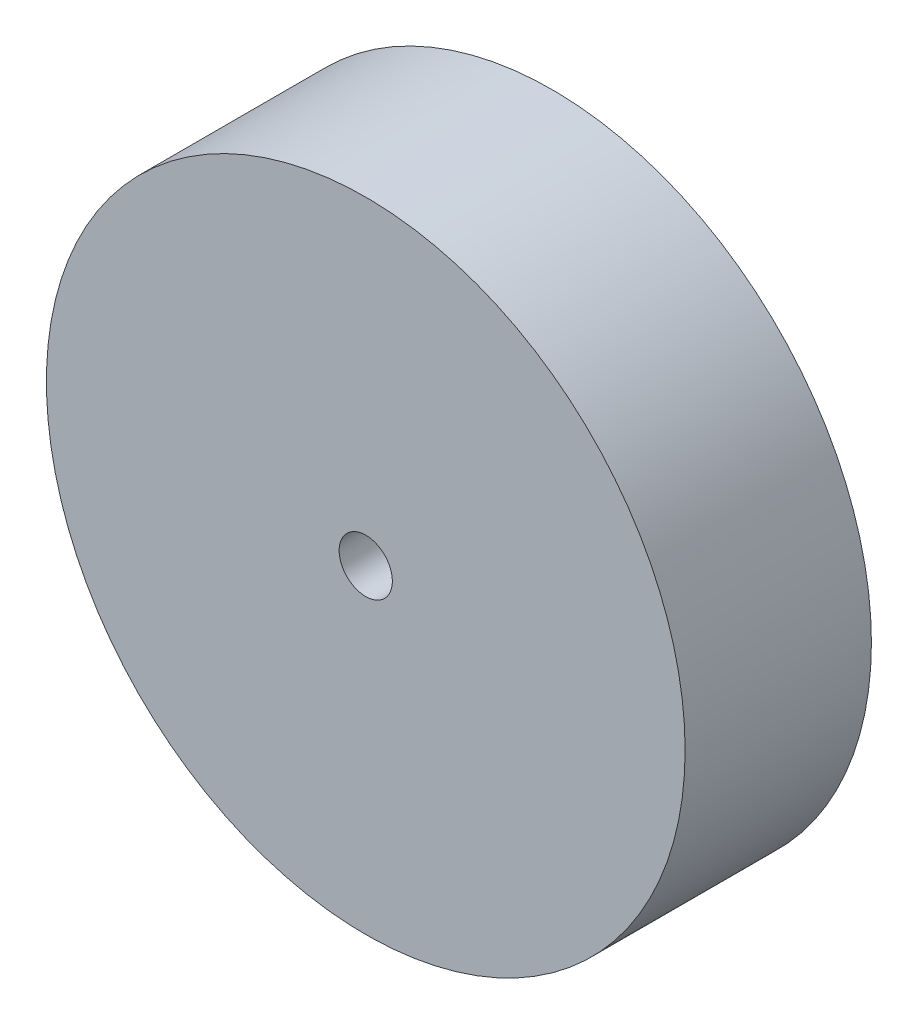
ISO-10303-21;
HEADER;
FILE_DESCRIPTION(('STEP AP214'),'2;1');
FILE_NAME('part.step','',(''),(''),'','','');
FILE_SCHEMA(('AUTOMOTIVE_DESIGN { 1 0 10303 214 1 1 1 1 }'));
ENDSEC;
DATA;
#1=APPLICATION_CONTEXT('core data for automotive mechanical design processes');
#2=APPLICATION_PROTOCOL_DEFINITION('international standard','automotive_design',2000,#1);
#3=PRODUCT_CONTEXT('',#1,'mechanical');
#4=PRODUCT('Part','Part','',(#3));
#5=PRODUCT_RELATED_PRODUCT_CATEGORY('part','',(#4));
#6=PRODUCT_DEFINITION_FORMATION('','',#4);
#7=PRODUCT_DEFINITION_CONTEXT('part definition',#1,'design');
#8=PRODUCT_DEFINITION('design','',#6,#7);
#9=PRODUCT_DEFINITION_SHAPE('','',#8);
#10=(LENGTH_UNIT() NAMED_UNIT(*) SI_UNIT(.MILLI.,.METRE.));
#11=(NAMED_UNIT(*) PLANE_ANGLE_UNIT() SI_UNIT($,.RADIAN.));
#12=(NAMED_UNIT(*) SI_UNIT($,.STERADIAN.) SOLID_ANGLE_UNIT());
#13=UNCERTAINTY_MEASURE_WITH_UNIT(LENGTH_MEASURE(1.E-05),#10,'distance_accuracy_value','');
#14=(GEOMETRIC_REPRESENTATION_CONTEXT(3) GLOBAL_UNCERTAINTY_ASSIGNED_CONTEXT((#13)) GLOBAL_UNIT_ASSIGNED_CONTEXT((#10,
#11,#12)) REPRESENTATION_CONTEXT('',''));
#15=CARTESIAN_POINT('',(0.,0.,0.));
#16=DIRECTION('',(0.,0.,1.));
#17=DIRECTION('',(1.,0.,0.));
#18=AXIS2_PLACEMENT_3D('',#15,#16,#17);
#19=CARTESIAN_POINT('',(0.,0.,22.225));
#20=DIRECTION('',(0.,0.,-1.));
#21=DIRECTION('',(-1.,0.,0.));
#22=AXIS2_PLACEMENT_3D('',#19,#20,#21);
#23=CYLINDRICAL_SURFACE('',#22,38.1);
#24=CARTESIAN_POINT('',(0.,0.,22.225));
#25=DIRECTION('',(0.,0.,1.));
#26=DIRECTION('',(1.,0.,0.));
#27=AXIS2_PLACEMENT_3D('',#24,#25,#26);
#28=CIRCLE('',#27,38.1);
#29=CARTESIAN_POINT('',(38.1,0.,22.225));
#30=VERTEX_POINT('',#29);
#31=EDGE_CURVE('E10',#30,#30,#28,.T.);
#32=ORIENTED_EDGE('',*,*,#31,.F.);
#33=EDGE_LOOP('',(#32));
#34=FACE_BOUND('',#33,.T.);
#35=CARTESIAN_POINT('',(0.,0.,0.));
#36=DIRECTION('',(0.,0.,1.));
#37=DIRECTION('',(1.,0.,0.));
#38=AXIS2_PLACEMENT_3D('',#35,#36,#37);
#39=CIRCLE('',#38,38.1);
#40=CARTESIAN_POINT('',(38.1,0.,0.));
#41=VERTEX_POINT('',#40);
#42=EDGE_CURVE('E39',#41,#41,#39,.T.);
#43=ORIENTED_EDGE('',*,*,#42,.T.);
#44=EDGE_LOOP('',(#43));
#45=FACE_BOUND('',#44,.T.);
#46=ADVANCED_FACE('F36',(#34,#45),#23,.T.);
#47=CARTESIAN_POINT('',(0.,0.,22.225));
#48=DIRECTION('',(0.,0.,1.));
#49=DIRECTION('',(1.,0.,0.));
#50=AXIS2_PLACEMENT_3D('',#47,#48,#49);
#51=PLANE('',#50);
#52=CARTESIAN_POINT('',(0.,0.,22.225));
#53=DIRECTION('',(0.,0.,1.));
#54=DIRECTION('',(1.,0.,0.));
#55=AXIS2_PLACEMENT_3D('',#52,#53,#54);
#56=CIRCLE('',#55,3.175);
#57=CARTESIAN_POINT('',(3.175,0.,22.225));
#58=VERTEX_POINT('',#57);
#59=EDGE_CURVE('E48',#58,#58,#56,.T.);
#60=ORIENTED_EDGE('',*,*,#59,.F.);
#61=EDGE_LOOP('',(#60));
#62=FACE_BOUND('',#61,.T.);
#63=ORIENTED_EDGE('',*,*,#31,.T.);
#64=EDGE_LOOP('',(#63));
#65=FACE_BOUND('',#64,.T.);
#66=ADVANCED_FACE('F63',(#62,#65),#51,.T.);
#67=CARTESIAN_POINT('',(0.,0.,0.));
#68=DIRECTION('',(0.,0.,1.));
#69=DIRECTION('',(1.,0.,0.));
#70=AXIS2_PLACEMENT_3D('',#67,#68,#69);
#71=PLANE('',#70);
#72=CARTESIAN_POINT('',(0.,0.,0.));
#73=DIRECTION('',(0.,0.,1.));
#74=DIRECTION('',(1.,0.,0.));
#75=AXIS2_PLACEMENT_3D('',#72,#73,#74);
#76=CIRCLE('',#75,3.175);
#77=CARTESIAN_POINT('',(3.175,0.,0.));
#78=VERTEX_POINT('',#77);
#79=EDGE_CURVE('E46',#78,#78,#76,.T.);
#80=ORIENTED_EDGE('',*,*,#79,.T.);
#81=EDGE_LOOP('',(#80));
#82=FACE_BOUND('',#81,.T.);
#83=ORIENTED_EDGE('',*,*,#42,.F.);
#84=EDGE_LOOP('',(#83));
#85=FACE_BOUND('',#84,.T.);
#86=ADVANCED_FACE('F54',(#82,#85),#71,.F.);
#87=CARTESIAN_POINT('',(0.,0.,0.));
#88=DIRECTION('',(0.,0.,1.));
#89=DIRECTION('',(1.,0.,0.));
#90=AXIS2_PLACEMENT_3D('',#87,#88,#89);
#91=CYLINDRICAL_SURFACE('',#90,3.175);
#92=ORIENTED_EDGE('',*,*,#79,.F.);
#93=EDGE_LOOP('',(#92));
#94=FACE_BOUND('',#93,.T.);
#95=ORIENTED_EDGE('',*,*,#59,.T.);
#96=EDGE_LOOP('',(#95));
#97=FACE_BOUND('',#96,.T.);
#98=ADVANCED_FACE('F57',(#94,#97),#91,.F.);
#99=CLOSED_SHELL('',(#46,#66,#86,#98));
#100=MANIFOLD_SOLID_BREP('B2',#99);
#101=ADVANCED_BREP_SHAPE_REPRESENTATION('',(#18,#100),#14);
#102=SHAPE_DEFINITION_REPRESENTATION(#9,#101);
ENDSEC;
END-ISO-10303-21;
